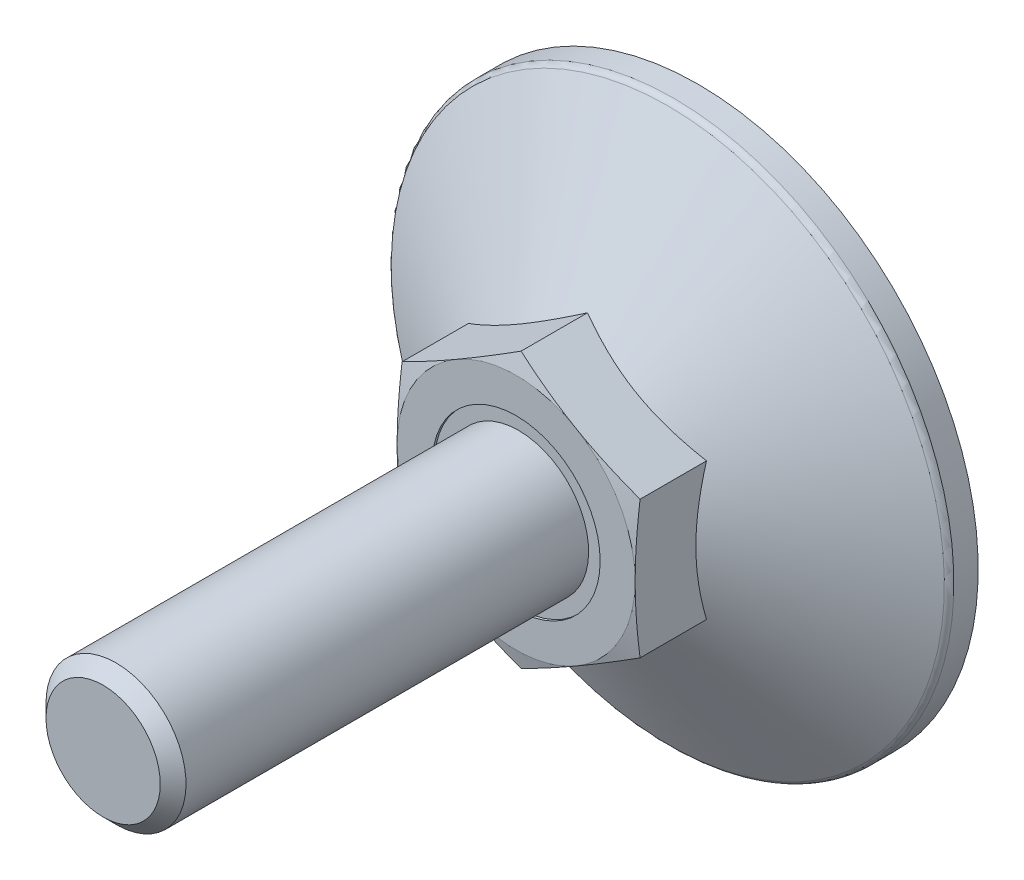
ISO-10303-21;
HEADER;
FILE_DESCRIPTION(('STEP AP214'),'2;1');
FILE_NAME('part.step','',(''),(''),'','','');
FILE_SCHEMA(('AUTOMOTIVE_DESIGN { 1 0 10303 214 1 1 1 1 }'));
ENDSEC;
DATA;
#1=APPLICATION_CONTEXT('core data for automotive mechanical design processes');
#2=APPLICATION_PROTOCOL_DEFINITION('international standard','automotive_design',2000,#1);
#3=PRODUCT_CONTEXT('',#1,'mechanical');
#4=PRODUCT('Part','Part','',(#3));
#5=PRODUCT_RELATED_PRODUCT_CATEGORY('part','',(#4));
#6=PRODUCT_DEFINITION_FORMATION('','',#4);
#7=PRODUCT_DEFINITION_CONTEXT('part definition',#1,'design');
#8=PRODUCT_DEFINITION('design','',#6,#7);
#9=PRODUCT_DEFINITION_SHAPE('','',#8);
#10=(LENGTH_UNIT() NAMED_UNIT(*) SI_UNIT(.MILLI.,.METRE.));
#11=(NAMED_UNIT(*) PLANE_ANGLE_UNIT() SI_UNIT($,.RADIAN.));
#12=(NAMED_UNIT(*) SI_UNIT($,.STERADIAN.) SOLID_ANGLE_UNIT());
#13=UNCERTAINTY_MEASURE_WITH_UNIT(LENGTH_MEASURE(1.E-05),#10,'distance_accuracy_value','');
#14=(GEOMETRIC_REPRESENTATION_CONTEXT(3) GLOBAL_UNCERTAINTY_ASSIGNED_CONTEXT((#13)) GLOBAL_UNIT_ASSIGNED_CONTEXT((#10,
#11,#12)) REPRESENTATION_CONTEXT('',''));
#15=CARTESIAN_POINT('',(0.,0.,0.));
#16=DIRECTION('',(0.,0.,1.));
#17=DIRECTION('',(1.,0.,0.));
#18=AXIS2_PLACEMENT_3D('',#15,#16,#17);
#19=CARTESIAN_POINT('',(0.,9.8149545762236,27.));
#20=DIRECTION('',(0.5,-0.86602540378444,0.));
#21=DIRECTION('',(0.86602540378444,0.5,0.));
#22=AXIS2_PLACEMENT_3D('',#19,#20,#21);
#23=PLANE('',#22);
#24=CARTESIAN_POINT('',(0.0002,9.81507004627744,12.6476280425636));
#25=CARTESIAN_POINT('',(-0.352800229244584,9.61126526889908,12.7022599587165));
#26=CARTESIAN_POINT('',(-0.706440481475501,9.40709097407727,12.7518566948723));
#27=CARTESIAN_POINT('',(-1.41496987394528,8.99802133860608,12.8389934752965));
#28=CARTESIAN_POINT('',(-1.76985946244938,8.79312573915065,12.8765286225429));
#29=CARTESIAN_POINT('',(-2.47873586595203,8.38385575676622,12.9373509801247));
#30=CARTESIAN_POINT('',(-2.83271788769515,8.17948414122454,12.9607107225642));
#31=CARTESIAN_POINT('',(-3.5411333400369,7.77048028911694,12.9920337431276));
#32=CARTESIAN_POINT('',(-3.89556667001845,7.56584811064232,13.));
#33=CARTESIAN_POINT('',(-4.60443332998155,7.15658375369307,13.));
#34=CARTESIAN_POINT('',(-4.9588666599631,6.95195157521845,12.9920337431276));
#35=CARTESIAN_POINT('',(-5.66728211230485,6.54294772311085,12.9607107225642));
#36=CARTESIAN_POINT('',(-6.02126413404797,6.33857610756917,12.9373509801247));
#37=CARTESIAN_POINT('',(-6.73014053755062,5.92930612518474,12.8765286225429));
#38=CARTESIAN_POINT('',(-7.08503012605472,5.7244105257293,12.8389934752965));
#39=CARTESIAN_POINT('',(-7.7935595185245,5.31534089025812,12.7518566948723));
#40=CARTESIAN_POINT('',(-8.14719977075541,5.11116659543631,12.7022599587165));
#41=CARTESIAN_POINT('',(-8.5002,4.90736181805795,12.6476280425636));
#42=B_SPLINE_CURVE_WITH_KNOTS('',3,(#24,#25,#26,#27,#28,#29,#30,#31,#32,#33,#34,#35,#36,#37,#38,
#39,#40,#41),.UNSPECIFIED.,.F.,.F.,(4,2,2,2,2,2,2,2,4),(0.,1.23382789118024,2.46815608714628,
3.69611406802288,4.92383440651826,6.15155474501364,7.37951272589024,8.61384092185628,
9.84766881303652),.UNSPECIFIED.);
#43=CARTESIAN_POINT('',(0.,9.8149545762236,12.6476589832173));
#44=VERTEX_POINT('',#43);
#45=CARTESIAN_POINT('',(-4.25,7.36121593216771,13.));
#46=VERTEX_POINT('',#45);
#47=EDGE_CURVE('E269',#44,#46,#42,.T.);
#48=ORIENTED_EDGE('',*,*,#47,.F.);
#49=DIRECTION('',(0.,0.,-1.));
#50=VECTOR('',#49,1.);
#51=CARTESIAN_POINT('',(0.,9.8149545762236,27.));
#52=LINE('',#51,#50);
#53=CARTESIAN_POINT('',(0.,9.8149545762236,7.90533871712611));
#54=VERTEX_POINT('',#53);
#55=EDGE_CURVE('E43',#44,#54,#52,.T.);
#56=ORIENTED_EDGE('',*,*,#55,.T.);
#57=CARTESIAN_POINT('',(-8.5002,4.90736181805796,7.90527204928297));
#58=CARTESIAN_POINT('',(-8.31336077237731,5.0152334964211,7.96754195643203));
#59=CARTESIAN_POINT('',(-8.1258249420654,5.12350735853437,8.02698579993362));
#60=CARTESIAN_POINT('',(-7.74923024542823,5.34093440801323,8.13944298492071));
#61=CARTESIAN_POINT('',(-7.56017075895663,5.45008795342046,8.19245355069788));
#62=CARTESIAN_POINT('',(-6.98996524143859,5.77929626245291,8.34079470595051));
#63=CARTESIAN_POINT('',(-6.60656835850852,6.00065055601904,8.42516916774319));
#64=CARTESIAN_POINT('',(-6.03282233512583,6.33190297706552,8.52410807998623));
#65=CARTESIAN_POINT('',(-5.8441872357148,6.44081150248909,8.55229289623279));
#66=CARTESIAN_POINT('',(-5.46606397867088,6.65912106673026,8.59955401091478));
#67=CARTESIAN_POINT('',(-5.27657589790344,6.76852206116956,8.61863111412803));
#68=CARTESIAN_POINT('',(-4.89727347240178,6.98751241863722,8.64719332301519));
#69=CARTESIAN_POINT('',(-4.70745974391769,7.0971014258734,8.65668931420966));
#70=CARTESIAN_POINT('',(-4.3276569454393,7.31638067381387,8.66588571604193));
#71=CARTESIAN_POINT('',(-4.13766788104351,7.42607091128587,8.66558642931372));
#72=CARTESIAN_POINT('',(-3.78247698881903,7.63114046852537,8.65587362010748));
#73=CARTESIAN_POINT('',(-3.61725009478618,7.7265342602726,8.64764492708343));
#74=CARTESIAN_POINT('',(-3.28718328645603,7.91709842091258,8.62393885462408));
#75=CARTESIAN_POINT('',(-3.12234339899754,8.01226877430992,8.60846098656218));
#76=CARTESIAN_POINT('',(-2.62846189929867,8.29741139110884,8.55151947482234));
#77=CARTESIAN_POINT('',(-2.30029449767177,8.48687892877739,8.49955503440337));
#78=CARTESIAN_POINT('',(-1.64047857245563,8.86782383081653,8.36964315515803));
#79=CARTESIAN_POINT('',(-1.30891425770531,9.0592525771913,8.29114502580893));
#80=CARTESIAN_POINT('',(-0.650730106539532,9.43925537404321,8.11298675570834));
#81=CARTESIAN_POINT('',(-0.324101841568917,9.62783429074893,8.01336845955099));
#82=CARTESIAN_POINT('',(0.000199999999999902,9.81507004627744,7.90527204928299));
#83=B_SPLINE_CURVE_WITH_KNOTS('',3,(#57,#58,#59,#60,#61,#62,#63,#64,#65,#66,#67,#68,#69,#70,#71,
#72,#73,#74,#75,#76,#77,#78,#79,#80,#81,#82),.UNSPECIFIED.,.F.,.F.,(4,2,2,2,2,2,2,2,2,2,2,2,4),
(0.,0.673596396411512,1.34748239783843,2.69805431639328,3.35679995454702,4.01548737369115,
4.67342558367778,5.33134346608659,5.90409556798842,6.47688628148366,7.62328361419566,
8.79510569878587,9.96462743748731),.UNSPECIFIED.);
#84=CARTESIAN_POINT('',(-8.5,4.9074772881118,7.90533871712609));
#85=VERTEX_POINT('',#84);
#86=EDGE_CURVE('E237',#85,#54,#83,.T.);
#87=ORIENTED_EDGE('',*,*,#86,.F.);
#88=DIRECTION('',(0.,0.,-1.));
#89=VECTOR('',#88,1.);
#90=CARTESIAN_POINT('',(-8.5,4.9074772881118,27.));
#91=LINE('',#90,#89);
#92=CARTESIAN_POINT('',(-8.5,4.9074772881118,12.6476589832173));
#93=VERTEX_POINT('',#92);
#94=EDGE_CURVE('E282',#93,#85,#91,.T.);
#95=ORIENTED_EDGE('',*,*,#94,.F.);
#96=EDGE_CURVE('E169',#46,#93,#42,.T.);
#97=ORIENTED_EDGE('',*,*,#96,.F.);
#98=EDGE_LOOP('',(#48,#56,#87,#95,#97));
#99=FACE_BOUND('',#98,.T.);
#100=ADVANCED_FACE('F14',(#99),#23,.F.);
#101=CARTESIAN_POINT('',(8.5,4.9074772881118,27.));
#102=DIRECTION('',(-0.5,-0.86602540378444,0.));
#103=DIRECTION('',(0.86602540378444,-0.5,0.));
#104=AXIS2_PLACEMENT_3D('',#101,#102,#103);
#105=PLANE('',#104);
#106=CARTESIAN_POINT('',(8.5002,4.90736181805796,12.6476280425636));
#107=CARTESIAN_POINT('',(8.14719977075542,5.11116659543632,12.7022599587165));
#108=CARTESIAN_POINT('',(7.7935595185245,5.31534089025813,12.7518566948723));
#109=CARTESIAN_POINT('',(7.08503012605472,5.72441052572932,12.8389934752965));
#110=CARTESIAN_POINT('',(6.73014053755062,5.92930612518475,12.8765286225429));
#111=CARTESIAN_POINT('',(6.02126413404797,6.33857610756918,12.9373509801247));
#112=CARTESIAN_POINT('',(5.66728211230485,6.54294772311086,12.9607107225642));
#113=CARTESIAN_POINT('',(4.9588666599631,6.95195157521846,12.9920337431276));
#114=CARTESIAN_POINT('',(4.60443332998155,7.15658375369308,13.));
#115=CARTESIAN_POINT('',(3.89556667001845,7.56584811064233,13.));
#116=CARTESIAN_POINT('',(3.5411333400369,7.77048028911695,12.9920337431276));
#117=CARTESIAN_POINT('',(2.83271788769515,8.17948414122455,12.9607107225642));
#118=CARTESIAN_POINT('',(2.47873586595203,8.38385575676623,12.9373509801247));
#119=CARTESIAN_POINT('',(1.76985946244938,8.79312573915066,12.8765286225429));
#120=CARTESIAN_POINT('',(1.41496987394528,8.99802133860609,12.8389934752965));
#121=CARTESIAN_POINT('',(0.706440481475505,9.40709097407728,12.7518566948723));
#122=CARTESIAN_POINT('',(0.352800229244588,9.61126526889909,12.7022599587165));
#123=CARTESIAN_POINT('',(-0.000199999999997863,9.81507004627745,12.6476280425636));
#124=B_SPLINE_CURVE_WITH_KNOTS('',3,(#106,#107,#108,#109,#110,#111,#112,#113,#114,#115,#116,
#117,#118,#119,#120,#121,#122,#123),.UNSPECIFIED.,.F.,.F.,(4,2,2,2,2,2,2,2,4),(0.,
1.23382789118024,2.46815608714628,3.69611406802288,4.92383440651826,6.15155474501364,
7.37951272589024,8.61384092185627,9.84766881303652),.UNSPECIFIED.);
#125=CARTESIAN_POINT('',(8.5,4.9074772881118,12.6476589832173));
#126=VERTEX_POINT('',#125);
#127=CARTESIAN_POINT('',(4.25,7.36121593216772,13.));
#128=VERTEX_POINT('',#127);
#129=EDGE_CURVE('E121',#126,#128,#124,.T.);
#130=ORIENTED_EDGE('',*,*,#129,.F.);
#131=DIRECTION('',(0.,0.,-1.));
#132=VECTOR('',#131,1.);
#133=CARTESIAN_POINT('',(8.5,4.9074772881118,27.));
#134=LINE('',#133,#132);
#135=CARTESIAN_POINT('',(8.5,4.9074772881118,7.90533871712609));
#136=VERTEX_POINT('',#135);
#137=EDGE_CURVE('E128',#126,#136,#134,.T.);
#138=ORIENTED_EDGE('',*,*,#137,.T.);
#139=CARTESIAN_POINT('',(-0.0002,9.81507004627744,7.90527204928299));
#140=CARTESIAN_POINT('',(0.186639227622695,9.7071983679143,7.96754195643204));
#141=CARTESIAN_POINT('',(0.374175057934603,9.59892450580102,8.02698579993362));
#142=CARTESIAN_POINT('',(0.750769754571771,9.38149745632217,8.13944298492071));
#143=CARTESIAN_POINT('',(0.939829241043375,9.27234391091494,8.19245355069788));
#144=CARTESIAN_POINT('',(1.51003475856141,8.94313560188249,8.34079470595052));
#145=CARTESIAN_POINT('',(1.89343164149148,8.72178130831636,8.42516916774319));
#146=CARTESIAN_POINT('',(2.46717766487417,8.39052888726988,8.52410807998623));
#147=CARTESIAN_POINT('',(2.6558127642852,8.28162036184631,8.55229289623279));
#148=CARTESIAN_POINT('',(3.03393602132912,8.06331079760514,8.59955401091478));
#149=CARTESIAN_POINT('',(3.22342410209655,7.95390980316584,8.61863111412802));
#150=CARTESIAN_POINT('',(3.60272652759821,7.73491944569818,8.64719332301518));
#151=CARTESIAN_POINT('',(3.79254025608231,7.62533043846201,8.65668931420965));
#152=CARTESIAN_POINT('',(4.1723430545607,7.40605119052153,8.66588571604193));
#153=CARTESIAN_POINT('',(4.36233211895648,7.29636095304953,8.66558642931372));
#154=CARTESIAN_POINT('',(4.71752301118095,7.09129139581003,8.65587362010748));
#155=CARTESIAN_POINT('',(4.88274990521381,6.9958976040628,8.64764492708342));
#156=CARTESIAN_POINT('',(5.21281671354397,6.80533344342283,8.62393885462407));
#157=CARTESIAN_POINT('',(5.37765660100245,6.71016309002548,8.60846098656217));
#158=CARTESIAN_POINT('',(5.87153810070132,6.42502047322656,8.55151947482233));
#159=CARTESIAN_POINT('',(6.19970550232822,6.23555293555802,8.49955503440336));
#160=CARTESIAN_POINT('',(6.85952142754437,5.85460803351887,8.36964315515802));
#161=CARTESIAN_POINT('',(7.19108574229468,5.6631792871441,8.29114502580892));
#162=CARTESIAN_POINT('',(7.84926989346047,5.28317649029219,8.11298675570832));
#163=CARTESIAN_POINT('',(8.17589815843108,5.09459757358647,8.01336845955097));
#164=CARTESIAN_POINT('',(8.5002,4.90736181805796,7.90527204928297));
#165=B_SPLINE_CURVE_WITH_KNOTS('',3,(#139,#140,#141,#142,#143,#144,#145,#146,#147,#148,#149,
#150,#151,#152,#153,#154,#155,#156,#157,#158,#159,#160,#161,#162,#163,#164),.UNSPECIFIED.,.F.,
.F.,(4,2,2,2,2,2,2,2,2,2,2,2,4),(0.,0.673596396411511,1.34748239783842,2.69805431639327,
3.35679995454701,4.01548737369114,4.67342558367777,5.33134346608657,5.90409556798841,
6.47688628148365,7.62328361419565,8.79510569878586,9.96462743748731),.UNSPECIFIED.);
#166=EDGE_CURVE('E231',#54,#136,#165,.T.);
#167=ORIENTED_EDGE('',*,*,#166,.F.);
#168=ORIENTED_EDGE('',*,*,#55,.F.);
#169=EDGE_CURVE('E138',#128,#44,#124,.T.);
#170=ORIENTED_EDGE('',*,*,#169,.F.);
#171=EDGE_LOOP('',(#130,#138,#167,#168,#170));
#172=FACE_BOUND('',#171,.T.);
#173=ADVANCED_FACE('F243',(#172),#105,.F.);
#174=CARTESIAN_POINT('',(8.5,-4.9074772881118,27.));
#175=DIRECTION('',(-1.,0.,0.));
#176=DIRECTION('',(0.,-1.,0.));
#177=AXIS2_PLACEMENT_3D('',#174,#175,#176);
#178=PLANE('',#177);
#179=CARTESIAN_POINT('',(8.5,-12.9903790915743,11.1178785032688));
#180=CARTESIAN_POINT('',(8.5,-12.6046640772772,11.2043386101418));
#181=CARTESIAN_POINT('',(8.5,-12.2187080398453,11.2897426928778));
#182=CARTESIAN_POINT('',(8.5,-11.4461955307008,11.4578687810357));
#183=CARTESIAN_POINT('',(8.5,-11.0596390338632,11.5405906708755));
#184=CARTESIAN_POINT('',(8.5,-10.2854620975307,11.7028540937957));
#185=CARTESIAN_POINT('',(8.5,-9.89784098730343,11.7823924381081));
#186=CARTESIAN_POINT('',(8.5,-9.12179257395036,11.9374315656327));
#187=CARTESIAN_POINT('',(8.5,-8.73336527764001,12.0129323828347));
#188=CARTESIAN_POINT('',(8.5,-7.95866003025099,12.1583532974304));
#189=CARTESIAN_POINT('',(8.5,-7.57238954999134,12.2283129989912));
#190=CARTESIAN_POINT('',(8.5,-6.79879542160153,12.3621336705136));
#191=CARTESIAN_POINT('',(8.5,-6.41147179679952,12.4259947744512));
#192=CARTESIAN_POINT('',(8.5,-5.63569520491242,12.5461821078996));
#193=CARTESIAN_POINT('',(8.5,-5.24724238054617,12.6025092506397));
#194=CARTESIAN_POINT('',(8.5,-4.46910032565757,12.7059702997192));
#195=CARTESIAN_POINT('',(8.5,-4.0794110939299,12.7531041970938));
#196=CARTESIAN_POINT('',(8.5,-3.29439639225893,12.836845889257));
#197=CARTESIAN_POINT('',(8.5,-2.89905727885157,12.8733276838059));
#198=CARTESIAN_POINT('',(8.5,-2.10738337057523,12.9332495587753));
#199=CARTESIAN_POINT('',(8.5,-1.71104859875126,12.9566899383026));
#200=CARTESIAN_POINT('',(8.5,-0.91795852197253,12.9891619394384));
#201=CARTESIAN_POINT('',(8.5,-0.521203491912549,12.9982001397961));
#202=CARTESIAN_POINT('',(8.5,0.272366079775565,13.0013119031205));
#203=CARTESIAN_POINT('',(8.5,0.669180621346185,12.9953854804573));
#204=CARTESIAN_POINT('',(8.5,1.46375572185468,12.9689012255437));
#205=CARTESIAN_POINT('',(8.5,1.8615144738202,12.9482902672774));
#206=CARTESIAN_POINT('',(8.5,2.65609763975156,12.8936142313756));
#207=CARTESIAN_POINT('',(8.5,3.05292203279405,12.8595488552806));
#208=CARTESIAN_POINT('',(8.5,3.84563292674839,12.779686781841));
#209=CARTESIAN_POINT('',(8.5,4.24151864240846,12.733882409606));
#210=CARTESIAN_POINT('',(8.5,5.03201569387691,12.632450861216));
#211=CARTESIAN_POINT('',(8.5,5.42662702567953,12.5768236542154));
#212=CARTESIAN_POINT('',(8.5,6.1890544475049,12.4613980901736));
#213=CARTESIAN_POINT('',(8.5,6.55694774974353,12.4021045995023));
#214=CARTESIAN_POINT('',(8.5,7.29176301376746,12.2777496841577));
#215=CARTESIAN_POINT('',(8.5,7.65868494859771,12.2126881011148));
#216=CARTESIAN_POINT('',(8.5,8.39169181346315,12.0778522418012));
#217=CARTESIAN_POINT('',(8.5,8.75777666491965,12.0080775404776));
#218=CARTESIAN_POINT('',(8.5,9.48919476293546,11.8646832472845));
#219=CARTESIAN_POINT('',(8.5,9.8545279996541,11.7910636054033));
#220=CARTESIAN_POINT('',(8.5,10.5846274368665,11.6406592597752));
#221=CARTESIAN_POINT('',(8.5,10.949393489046,11.5638738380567));
#222=CARTESIAN_POINT('',(8.5,11.6783699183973,11.4077053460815));
#223=CARTESIAN_POINT('',(8.5,12.042580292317,11.3283222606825));
#224=CARTESIAN_POINT('',(8.5,13.1344530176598,11.086978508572));
#225=CARTESIAN_POINT('',(8.5,13.8614066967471,10.9218129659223));
#226=CARTESIAN_POINT('',(8.5,15.3067849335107,10.5871769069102));
#227=CARTESIAN_POINT('',(8.5,16.0252230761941,10.4177646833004));
#228=CARTESIAN_POINT('',(8.5,17.4610979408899,10.0746978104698));
#229=CARTESIAN_POINT('',(8.5,18.1785346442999,9.90104308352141));
#230=CARTESIAN_POINT('',(8.5,19.6117525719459,9.55082113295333));
#231=CARTESIAN_POINT('',(8.5,20.3275347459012,9.37425778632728));
#232=CARTESIAN_POINT('',(8.5,21.7584760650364,9.01872306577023));
#233=CARTESIAN_POINT('',(8.5,22.4736352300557,8.83975177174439));
#234=CARTESIAN_POINT('',(8.5,23.188577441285,8.65992757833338));
#235=B_SPLINE_CURVE_WITH_KNOTS('',3,(#179,#180,#181,#182,#183,#184,#185,#186,#187,#188,#189,
#190,#191,#192,#193,#194,#195,#196,#197,#198,#199,#200,#201,#202,#203,#204,#205,#206,#207,#208,
#209,#210,#211,#212,#213,#214,#215,#216,#217,#218,#219,#220,#221,#222,#223,#224,#225,#226,#227,
#228,#229,#230,#231,#232,#233,#234),.UNSPECIFIED.,.F.,.F.,(4,2,2,2,2,2,2,2,2,2,2,2,2,2,2,2,2,2,
2,2,2,2,2,2,2,2,2,4),(0.,1.18586433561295,2.37177970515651,3.55885463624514,4.74591957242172,
5.92354482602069,7.1011442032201,8.27860070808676,9.45605836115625,10.646926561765,
11.8377674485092,13.0280642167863,14.2183598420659,15.4129837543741,16.6076341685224,
17.8030676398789,18.9985048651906,20.1163732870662,21.2342724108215,22.3522724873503,
23.470287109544,24.5885566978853,25.7068328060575,27.9432326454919,30.1576442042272,
32.3720963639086,34.5838036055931,36.7954376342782),.UNSPECIFIED.);
#236=CARTESIAN_POINT('',(8.5,-4.90747728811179,12.6476589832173));
#237=VERTEX_POINT('',#236);
#238=CARTESIAN_POINT('',(8.5,0.,13.));
#239=VERTEX_POINT('',#238);
#240=EDGE_CURVE('E95',#237,#239,#235,.T.);
#241=ORIENTED_EDGE('',*,*,#240,.F.);
#242=DIRECTION('',(0.,0.,-1.));
#243=VECTOR('',#242,1.);
#244=CARTESIAN_POINT('',(8.5,-4.9074772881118,27.));
#245=LINE('',#244,#243);
#246=CARTESIAN_POINT('',(8.5,-4.9074772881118,7.90533871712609));
#247=VERTEX_POINT('',#246);
#248=EDGE_CURVE('E275',#237,#247,#245,.T.);
#249=ORIENTED_EDGE('',*,*,#248,.T.);
#250=CARTESIAN_POINT('',(8.5,12.7492767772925,4.72527230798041));
#251=CARTESIAN_POINT('',(8.5,12.3811478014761,4.90206026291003));
#252=CARTESIAN_POINT('',(8.5,12.0121249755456,5.07702151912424));
#253=CARTESIAN_POINT('',(8.5,11.2718137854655,5.42225230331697));
#254=CARTESIAN_POINT('',(8.5,10.9005250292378,5.59252098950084));
#255=CARTESIAN_POINT('',(8.5,10.1530767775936,5.92827896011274));
#256=CARTESIAN_POINT('',(8.5,9.77690140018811,6.09373302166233));
#257=CARTESIAN_POINT('',(8.5,9.02139912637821,6.41725455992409));
#258=CARTESIAN_POINT('',(8.5,8.64207239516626,6.57532242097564));
#259=CARTESIAN_POINT('',(8.5,7.86979942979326,6.88607334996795));
#260=CARTESIAN_POINT('',(8.5,7.47675434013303,7.03851219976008));
#261=CARTESIAN_POINT('',(8.5,6.68591204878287,7.33076935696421));
#262=CARTESIAN_POINT('',(8.5,6.28811429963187,7.47058619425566));
#263=CARTESIAN_POINT('',(8.5,5.48802263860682,7.733611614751));
#264=CARTESIAN_POINT('',(8.5,5.08574124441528,7.85685783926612));
#265=CARTESIAN_POINT('',(8.5,4.27544970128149,8.08251258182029));
#266=CARTESIAN_POINT('',(8.5,3.86744153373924,8.18492812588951));
#267=CARTESIAN_POINT('',(8.5,3.04728386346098,8.36327495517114));
#268=CARTESIAN_POINT('',(8.5,2.6351585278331,8.43931422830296));
#269=CARTESIAN_POINT('',(8.5,2.01359122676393,8.53003978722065));
#270=CARTESIAN_POINT('',(8.5,1.80582110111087,8.55639399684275));
#271=CARTESIAN_POINT('',(8.5,1.38940213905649,8.60080126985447));
#272=CARTESIAN_POINT('',(8.5,1.18075338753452,8.61885511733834));
#273=CARTESIAN_POINT('',(8.5,0.765376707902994,8.64609671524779));
#274=CARTESIAN_POINT('',(8.5,0.558655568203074,8.65538769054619));
#275=CARTESIAN_POINT('',(8.5,0.1450067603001,8.66526416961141));
#276=CARTESIAN_POINT('',(8.5,-0.0619209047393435,8.6658498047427));
#277=CARTESIAN_POINT('',(8.5,-0.475626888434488,8.65830085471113));
#278=CARTESIAN_POINT('',(8.5,-0.682405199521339,8.65016585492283));
#279=CARTESIAN_POINT('',(8.5,-1.09545270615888,8.625363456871));
#280=CARTESIAN_POINT('',(8.5,-1.30172187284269,8.60869558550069));
#281=CARTESIAN_POINT('',(8.5,-1.81090940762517,8.55735076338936));
#282=CARTESIAN_POINT('',(8.5,-2.11335210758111,8.51788364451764));
#283=CARTESIAN_POINT('',(8.5,-2.71570235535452,8.4228634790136));
#284=CARTESIAN_POINT('',(8.5,-3.01560949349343,8.36730788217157));
#285=CARTESIAN_POINT('',(8.5,-3.61268959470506,8.2420877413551));
#286=CARTESIAN_POINT('',(8.5,-3.90986014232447,8.17241178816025));
#287=CARTESIAN_POINT('',(8.5,-4.50108875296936,8.02104250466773));
#288=CARTESIAN_POINT('',(8.5,-4.79514688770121,7.93934945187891));
#289=CARTESIAN_POINT('',(8.5,-5.3871494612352,7.7638116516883));
#290=CARTESIAN_POINT('',(8.5,-5.68502188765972,7.6697256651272));
#291=CARTESIAN_POINT('',(8.5,-6.27782977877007,7.4727599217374));
#292=CARTESIAN_POINT('',(8.5,-6.57276522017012,7.36988009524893));
#293=CARTESIAN_POINT('',(8.5,-7.15987047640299,7.15687683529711));
#294=CARTESIAN_POINT('',(8.5,-7.45204129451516,7.04675615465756));
#295=CARTESIAN_POINT('',(8.5,-8.03401937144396,6.82048197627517));
#296=CARTESIAN_POINT('',(8.5,-8.32382669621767,6.70432864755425));
#297=CARTESIAN_POINT('',(8.5,-8.8985343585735,6.468166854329));
#298=CARTESIAN_POINT('',(8.5,-9.18345493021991,6.34820749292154));
#299=CARTESIAN_POINT('',(8.5,-9.75152375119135,6.10415692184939));
#300=CARTESIAN_POINT('',(8.5,-10.034671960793,5.98006561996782));
#301=CARTESIAN_POINT('',(8.5,-10.8818575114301,5.60257794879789));
#302=CARTESIAN_POINT('',(8.5,-11.4435817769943,5.34399030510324));
#303=CARTESIAN_POINT('',(8.5,-12.5625477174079,4.81675169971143));
#304=CARTESIAN_POINT('',(8.5,-13.1197873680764,4.54809647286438));
#305=CARTESIAN_POINT('',(8.5,-14.2306052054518,4.00340707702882));
#306=CARTESIAN_POINT('',(8.5,-14.7841835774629,3.72737328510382));
#307=CARTESIAN_POINT('',(8.5,-15.8894273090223,3.16924748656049));
#308=CARTESIAN_POINT('',(8.5,-16.4410879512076,2.88714616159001));
#309=CARTESIAN_POINT('',(8.5,-17.5421722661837,2.31860293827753));
#310=CARTESIAN_POINT('',(8.5,-18.0915959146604,2.03216099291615));
#311=CARTESIAN_POINT('',(8.5,-19.1885131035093,1.45593769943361));
#312=CARTESIAN_POINT('',(8.5,-19.7360070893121,1.1661571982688));
#313=CARTESIAN_POINT('',(8.5,-20.8295421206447,0.583866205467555));
#314=CARTESIAN_POINT('',(8.5,-21.3755831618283,0.291355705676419));
#315=CARTESIAN_POINT('',(8.5,-22.8810608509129,-0.519031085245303));
#316=CARTESIAN_POINT('',(8.5,-23.8392547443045,-1.03921546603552));
#317=CARTESIAN_POINT('',(8.5,-25.7530641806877,-2.08445783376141));
#318=CARTESIAN_POINT('',(8.5,-26.708679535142,-2.60951616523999));
#319=CARTESIAN_POINT('',(8.5,-28.6148788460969,-3.66152013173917));
#320=CARTESIAN_POINT('',(8.5,-29.565469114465,-4.18845433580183));
#321=CARTESIAN_POINT('',(8.5,-30.9901906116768,-4.98085413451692));
#322=CARTESIAN_POINT('',(8.5,-31.4648842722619,-5.24530955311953));
#323=CARTESIAN_POINT('',(8.5,-32.4139385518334,-5.77481644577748));
#324=CARTESIAN_POINT('',(8.5,-32.8882991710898,-6.03986791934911));
#325=CARTESIAN_POINT('',(8.5,-33.3625145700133,-6.30517901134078));
#326=B_SPLINE_CURVE_WITH_KNOTS('',3,(#250,#251,#252,#253,#254,#255,#256,#257,#258,#259,#260,
#261,#262,#263,#264,#265,#266,#267,#268,#269,#270,#271,#272,#273,#274,#275,#276,#277,#278,#279,
#280,#281,#282,#283,#284,#285,#286,#287,#288,#289,#290,#291,#292,#293,#294,#295,#296,#297,#298,
#299,#300,#301,#302,#303,#304,#305,#306,#307,#308,#309,#310,#311,#312,#313,#314,#315,#316,#317,
#318,#319,#320,#321,#322,#323,#324,#325),.UNSPECIFIED.,.F.,.F.,(4,2,2,2,2,2,2,2,2,2,2,2,2,2,2,2,
2,2,2,2,2,2,2,2,2,2,2,2,2,2,2,2,2,2,2,2,2,4),(0.,1.22515253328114,2.45052343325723,
3.6833213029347,4.91605495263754,6.18059988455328,7.44529191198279,8.70706073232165,
9.96840325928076,11.2245189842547,11.852683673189,12.4807890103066,13.1013994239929,
13.7220004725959,14.3426310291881,14.9632960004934,15.8778021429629,16.7924533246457,
17.7078465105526,18.6232185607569,19.5601888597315,20.4971665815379,21.433790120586,
22.3703874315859,23.297780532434,24.225194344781,26.0801973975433,27.9359954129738,
29.7916987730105,31.6504906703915,33.5093027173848,35.3676531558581,37.2260091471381,
40.4968499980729,43.7679238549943,47.0285209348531,48.6586852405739,50.2888482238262),.UNSPECIFIED.);
#327=EDGE_CURVE('E197',#136,#247,#326,.T.);
#328=ORIENTED_EDGE('',*,*,#327,.F.);
#329=ORIENTED_EDGE('',*,*,#137,.F.);
#330=EDGE_CURVE('E106',#239,#126,#235,.T.);
#331=ORIENTED_EDGE('',*,*,#330,.F.);
#332=EDGE_LOOP('',(#241,#249,#328,#329,#331));
#333=FACE_BOUND('',#332,.T.);
#334=ADVANCED_FACE('F126',(#333),#178,.F.);
#335=CARTESIAN_POINT('',(0.,-9.8149545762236,27.));
#336=DIRECTION('',(-0.5,0.86602540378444,0.));
#337=DIRECTION('',(-0.86602540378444,-0.5,0.));
#338=AXIS2_PLACEMENT_3D('',#335,#336,#337);
#339=PLANE('',#338);
#340=CARTESIAN_POINT('',(-0.0002,-9.81507004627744,12.6476280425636));
#341=CARTESIAN_POINT('',(0.352800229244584,-9.61126526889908,12.7022599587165));
#342=CARTESIAN_POINT('',(0.706440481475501,-9.40709097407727,12.7518566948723));
#343=CARTESIAN_POINT('',(1.41496987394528,-8.99802133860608,12.8389934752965));
#344=CARTESIAN_POINT('',(1.76985946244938,-8.79312573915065,12.8765286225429));
#345=CARTESIAN_POINT('',(2.47873586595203,-8.38385575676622,12.9373509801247));
#346=CARTESIAN_POINT('',(2.83271788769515,-8.17948414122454,12.9607107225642));
#347=CARTESIAN_POINT('',(3.5411333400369,-7.77048028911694,12.9920337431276));
#348=CARTESIAN_POINT('',(3.89556667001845,-7.56584811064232,13.));
#349=CARTESIAN_POINT('',(4.60443332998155,-7.15658375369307,13.));
#350=CARTESIAN_POINT('',(4.9588666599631,-6.95195157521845,12.9920337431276));
#351=CARTESIAN_POINT('',(5.66728211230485,-6.54294772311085,12.9607107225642));
#352=CARTESIAN_POINT('',(6.02126413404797,-6.33857610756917,12.9373509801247));
#353=CARTESIAN_POINT('',(6.73014053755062,-5.92930612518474,12.8765286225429));
#354=CARTESIAN_POINT('',(7.08503012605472,-5.7244105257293,12.8389934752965));
#355=CARTESIAN_POINT('',(7.7935595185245,-5.31534089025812,12.7518566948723));
#356=CARTESIAN_POINT('',(8.14719977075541,-5.11116659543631,12.7022599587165));
#357=CARTESIAN_POINT('',(8.5002,-4.90736181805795,12.6476280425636));
#358=B_SPLINE_CURVE_WITH_KNOTS('',3,(#340,#341,#342,#343,#344,#345,#346,#347,#348,#349,#350,
#351,#352,#353,#354,#355,#356,#357),.UNSPECIFIED.,.F.,.F.,(4,2,2,2,2,2,2,2,4),(0.,
1.23382789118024,2.46815608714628,3.69611406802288,4.92383440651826,6.15155474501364,
7.37951272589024,8.61384092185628,9.84766881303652),.UNSPECIFIED.);
#359=CARTESIAN_POINT('',(0.,-9.81495457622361,12.6476589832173));
#360=VERTEX_POINT('',#359);
#361=CARTESIAN_POINT('',(4.25,-7.36121593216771,13.));
#362=VERTEX_POINT('',#361);
#363=EDGE_CURVE('E130',#360,#362,#358,.T.);
#364=ORIENTED_EDGE('',*,*,#363,.F.);
#365=DIRECTION('',(0.,0.,-1.));
#366=VECTOR('',#365,1.);
#367=CARTESIAN_POINT('',(0.,-9.8149545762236,27.));
#368=LINE('',#367,#366);
#369=CARTESIAN_POINT('',(0.,-9.8149545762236,7.90533871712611));
#370=VERTEX_POINT('',#369);
#371=EDGE_CURVE('E279',#360,#370,#368,.T.);
#372=ORIENTED_EDGE('',*,*,#371,.T.);
#373=CARTESIAN_POINT('',(8.5002,-4.90736181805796,7.90527204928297));
#374=CARTESIAN_POINT('',(8.31336077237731,-5.0152334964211,7.96754195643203));
#375=CARTESIAN_POINT('',(8.1258249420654,-5.12350735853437,8.02698579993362));
#376=CARTESIAN_POINT('',(7.74923024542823,-5.34093440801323,8.13944298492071));
#377=CARTESIAN_POINT('',(7.56017075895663,-5.45008795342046,8.19245355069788));
#378=CARTESIAN_POINT('',(6.98996524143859,-5.77929626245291,8.34079470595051));
#379=CARTESIAN_POINT('',(6.60656835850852,-6.00065055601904,8.42516916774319));
#380=CARTESIAN_POINT('',(6.03282233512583,-6.33190297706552,8.52410807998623));
#381=CARTESIAN_POINT('',(5.8441872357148,-6.44081150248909,8.55229289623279));
#382=CARTESIAN_POINT('',(5.46606397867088,-6.65912106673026,8.59955401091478));
#383=CARTESIAN_POINT('',(5.27657589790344,-6.76852206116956,8.61863111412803));
#384=CARTESIAN_POINT('',(4.89727347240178,-6.98751241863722,8.64719332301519));
#385=CARTESIAN_POINT('',(4.70745974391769,-7.0971014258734,8.65668931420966));
#386=CARTESIAN_POINT('',(4.3276569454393,-7.31638067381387,8.66588571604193));
#387=CARTESIAN_POINT('',(4.13766788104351,-7.42607091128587,8.66558642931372));
#388=CARTESIAN_POINT('',(3.78247698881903,-7.63114046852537,8.65587362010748));
#389=CARTESIAN_POINT('',(3.61725009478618,-7.7265342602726,8.64764492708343));
#390=CARTESIAN_POINT('',(3.28718328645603,-7.91709842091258,8.62393885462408));
#391=CARTESIAN_POINT('',(3.12234339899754,-8.01226877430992,8.60846098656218));
#392=CARTESIAN_POINT('',(2.62846189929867,-8.29741139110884,8.55151947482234));
#393=CARTESIAN_POINT('',(2.30029449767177,-8.48687892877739,8.49955503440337));
#394=CARTESIAN_POINT('',(1.64047857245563,-8.86782383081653,8.36964315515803));
#395=CARTESIAN_POINT('',(1.30891425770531,-9.0592525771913,8.29114502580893));
#396=CARTESIAN_POINT('',(0.650730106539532,-9.43925537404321,8.11298675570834));
#397=CARTESIAN_POINT('',(0.324101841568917,-9.62783429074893,8.01336845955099));
#398=CARTESIAN_POINT('',(-0.000199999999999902,-9.81507004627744,7.90527204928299));
#399=B_SPLINE_CURVE_WITH_KNOTS('',3,(#373,#374,#375,#376,#377,#378,#379,#380,#381,#382,#383,
#384,#385,#386,#387,#388,#389,#390,#391,#392,#393,#394,#395,#396,#397,#398),.UNSPECIFIED.,.F.,
.F.,(4,2,2,2,2,2,2,2,2,2,2,2,4),(0.,0.673596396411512,1.34748239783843,2.69805431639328,
3.35679995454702,4.01548737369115,4.67342558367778,5.33134346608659,5.90409556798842,
6.47688628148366,7.62328361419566,8.79510569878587,9.96462743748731),.UNSPECIFIED.);
#400=EDGE_CURVE('E188',#247,#370,#399,.T.);
#401=ORIENTED_EDGE('',*,*,#400,.F.);
#402=ORIENTED_EDGE('',*,*,#248,.F.);
#403=EDGE_CURVE('E101',#362,#237,#358,.T.);
#404=ORIENTED_EDGE('',*,*,#403,.F.);
#405=EDGE_LOOP('',(#364,#372,#401,#402,#404));
#406=FACE_BOUND('',#405,.T.);
#407=ADVANCED_FACE('F180',(#406),#339,.F.);
#408=CARTESIAN_POINT('',(-8.5,-4.9074772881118,27.));
#409=DIRECTION('',(0.5,0.86602540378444,0.));
#410=DIRECTION('',(-0.86602540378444,0.5,0.));
#411=AXIS2_PLACEMENT_3D('',#408,#409,#410);
#412=PLANE('',#411);
#413=CARTESIAN_POINT('',(-8.5002,-4.90736181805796,12.6476280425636));
#414=CARTESIAN_POINT('',(-8.14719977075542,-5.11116659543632,12.7022599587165));
#415=CARTESIAN_POINT('',(-7.7935595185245,-5.31534089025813,12.7518566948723));
#416=CARTESIAN_POINT('',(-7.08503012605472,-5.72441052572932,12.8389934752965));
#417=CARTESIAN_POINT('',(-6.73014053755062,-5.92930612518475,12.8765286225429));
#418=CARTESIAN_POINT('',(-6.02126413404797,-6.33857610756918,12.9373509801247));
#419=CARTESIAN_POINT('',(-5.66728211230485,-6.54294772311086,12.9607107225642));
#420=CARTESIAN_POINT('',(-4.9588666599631,-6.95195157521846,12.9920337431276));
#421=CARTESIAN_POINT('',(-4.60443332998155,-7.15658375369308,13.));
#422=CARTESIAN_POINT('',(-3.89556667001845,-7.56584811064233,13.));
#423=CARTESIAN_POINT('',(-3.5411333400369,-7.77048028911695,12.9920337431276));
#424=CARTESIAN_POINT('',(-2.83271788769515,-8.17948414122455,12.9607107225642));
#425=CARTESIAN_POINT('',(-2.47873586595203,-8.38385575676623,12.9373509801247));
#426=CARTESIAN_POINT('',(-1.76985946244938,-8.79312573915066,12.8765286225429));
#427=CARTESIAN_POINT('',(-1.41496987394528,-8.99802133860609,12.8389934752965));
#428=CARTESIAN_POINT('',(-0.706440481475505,-9.40709097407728,12.7518566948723));
#429=CARTESIAN_POINT('',(-0.352800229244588,-9.61126526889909,12.7022599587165));
#430=CARTESIAN_POINT('',(0.000199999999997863,-9.81507004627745,12.6476280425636));
#431=B_SPLINE_CURVE_WITH_KNOTS('',3,(#413,#414,#415,#416,#417,#418,#419,#420,#421,#422,#423,
#424,#425,#426,#427,#428,#429,#430),.UNSPECIFIED.,.F.,.F.,(4,2,2,2,2,2,2,2,4),(0.,
1.23382789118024,2.46815608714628,3.69611406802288,4.92383440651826,6.15155474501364,
7.37951272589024,8.61384092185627,9.84766881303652),.UNSPECIFIED.);
#432=CARTESIAN_POINT('',(-8.5,-4.9074772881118,12.6476589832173));
#433=VERTEX_POINT('',#432);
#434=CARTESIAN_POINT('',(-4.25,-7.36121593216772,13.));
#435=VERTEX_POINT('',#434);
#436=EDGE_CURVE('E161',#433,#435,#431,.T.);
#437=ORIENTED_EDGE('',*,*,#436,.F.);
#438=DIRECTION('',(0.,0.,-1.));
#439=VECTOR('',#438,1.);
#440=CARTESIAN_POINT('',(-8.5,-4.9074772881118,27.));
#441=LINE('',#440,#439);
#442=CARTESIAN_POINT('',(-8.5,-4.9074772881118,7.90533871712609));
#443=VERTEX_POINT('',#442);
#444=EDGE_CURVE('E281',#433,#443,#441,.T.);
#445=ORIENTED_EDGE('',*,*,#444,.T.);
#446=CARTESIAN_POINT('',(0.0002,-9.81507004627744,7.90527204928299));
#447=CARTESIAN_POINT('',(-0.186639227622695,-9.7071983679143,7.96754195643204));
#448=CARTESIAN_POINT('',(-0.374175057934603,-9.59892450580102,8.02698579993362));
#449=CARTESIAN_POINT('',(-0.750769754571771,-9.38149745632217,8.13944298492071));
#450=CARTESIAN_POINT('',(-0.939829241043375,-9.27234391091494,8.19245355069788));
#451=CARTESIAN_POINT('',(-1.51003475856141,-8.94313560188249,8.34079470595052));
#452=CARTESIAN_POINT('',(-1.89343164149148,-8.72178130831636,8.42516916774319));
#453=CARTESIAN_POINT('',(-2.46717766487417,-8.39052888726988,8.52410807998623));
#454=CARTESIAN_POINT('',(-2.6558127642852,-8.28162036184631,8.55229289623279));
#455=CARTESIAN_POINT('',(-3.03393602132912,-8.06331079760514,8.59955401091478));
#456=CARTESIAN_POINT('',(-3.22342410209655,-7.95390980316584,8.61863111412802));
#457=CARTESIAN_POINT('',(-3.60272652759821,-7.73491944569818,8.64719332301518));
#458=CARTESIAN_POINT('',(-3.79254025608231,-7.62533043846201,8.65668931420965));
#459=CARTESIAN_POINT('',(-4.1723430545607,-7.40605119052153,8.66588571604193));
#460=CARTESIAN_POINT('',(-4.36233211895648,-7.29636095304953,8.66558642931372));
#461=CARTESIAN_POINT('',(-4.71752301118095,-7.09129139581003,8.65587362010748));
#462=CARTESIAN_POINT('',(-4.88274990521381,-6.9958976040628,8.64764492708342));
#463=CARTESIAN_POINT('',(-5.21281671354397,-6.80533344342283,8.62393885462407));
#464=CARTESIAN_POINT('',(-5.37765660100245,-6.71016309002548,8.60846098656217));
#465=CARTESIAN_POINT('',(-5.87153810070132,-6.42502047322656,8.55151947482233));
#466=CARTESIAN_POINT('',(-6.19970550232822,-6.23555293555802,8.49955503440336));
#467=CARTESIAN_POINT('',(-6.85952142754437,-5.85460803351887,8.36964315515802));
#468=CARTESIAN_POINT('',(-7.19108574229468,-5.6631792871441,8.29114502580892));
#469=CARTESIAN_POINT('',(-7.84926989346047,-5.28317649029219,8.11298675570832));
#470=CARTESIAN_POINT('',(-8.17589815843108,-5.09459757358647,8.01336845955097));
#471=CARTESIAN_POINT('',(-8.5002,-4.90736181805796,7.90527204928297));
#472=B_SPLINE_CURVE_WITH_KNOTS('',3,(#446,#447,#448,#449,#450,#451,#452,#453,#454,#455,#456,
#457,#458,#459,#460,#461,#462,#463,#464,#465,#466,#467,#468,#469,#470,#471),.UNSPECIFIED.,.F.,
.F.,(4,2,2,2,2,2,2,2,2,2,2,2,4),(0.,0.673596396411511,1.34748239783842,2.69805431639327,
3.35679995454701,4.01548737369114,4.67342558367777,5.33134346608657,5.90409556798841,
6.47688628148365,7.62328361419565,8.79510569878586,9.96462743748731),.UNSPECIFIED.);
#473=EDGE_CURVE('E198',#370,#443,#472,.T.);
#474=ORIENTED_EDGE('',*,*,#473,.F.);
#475=ORIENTED_EDGE('',*,*,#371,.F.);
#476=EDGE_CURVE('E179',#435,#360,#431,.T.);
#477=ORIENTED_EDGE('',*,*,#476,.F.);
#478=EDGE_LOOP('',(#437,#445,#474,#475,#477));
#479=FACE_BOUND('',#478,.T.);
#480=ADVANCED_FACE('F183',(#479),#412,.F.);
#481=CARTESIAN_POINT('',(-8.5,4.9074772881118,27.));
#482=DIRECTION('',(1.,0.,0.));
#483=DIRECTION('',(0.,1.,0.));
#484=AXIS2_PLACEMENT_3D('',#481,#482,#483);
#485=PLANE('',#484);
#486=CARTESIAN_POINT('',(-8.5,-12.9903790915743,11.1178785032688));
#487=CARTESIAN_POINT('',(-8.5,-12.6046640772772,11.2043386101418));
#488=CARTESIAN_POINT('',(-8.5,-12.2187080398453,11.2897426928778));
#489=CARTESIAN_POINT('',(-8.5,-11.4461955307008,11.4578687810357));
#490=CARTESIAN_POINT('',(-8.5,-11.0596390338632,11.5405906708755));
#491=CARTESIAN_POINT('',(-8.5,-10.2854620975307,11.7028540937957));
#492=CARTESIAN_POINT('',(-8.5,-9.89784098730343,11.7823924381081));
#493=CARTESIAN_POINT('',(-8.5,-9.12179257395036,11.9374315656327));
#494=CARTESIAN_POINT('',(-8.5,-8.73336527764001,12.0129323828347));
#495=CARTESIAN_POINT('',(-8.5,-7.95866003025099,12.1583532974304));
#496=CARTESIAN_POINT('',(-8.5,-7.57238954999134,12.2283129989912));
#497=CARTESIAN_POINT('',(-8.5,-6.79879542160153,12.3621336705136));
#498=CARTESIAN_POINT('',(-8.5,-6.41147179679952,12.4259947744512));
#499=CARTESIAN_POINT('',(-8.5,-5.63569520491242,12.5461821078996));
#500=CARTESIAN_POINT('',(-8.5,-5.24724238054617,12.6025092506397));
#501=CARTESIAN_POINT('',(-8.5,-4.46910032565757,12.7059702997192));
#502=CARTESIAN_POINT('',(-8.5,-4.0794110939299,12.7531041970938));
#503=CARTESIAN_POINT('',(-8.5,-3.29439639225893,12.836845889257));
#504=CARTESIAN_POINT('',(-8.5,-2.89905727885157,12.8733276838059));
#505=CARTESIAN_POINT('',(-8.5,-2.10738337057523,12.9332495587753));
#506=CARTESIAN_POINT('',(-8.5,-1.71104859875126,12.9566899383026));
#507=CARTESIAN_POINT('',(-8.5,-0.91795852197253,12.9891619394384));
#508=CARTESIAN_POINT('',(-8.5,-0.521203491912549,12.9982001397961));
#509=CARTESIAN_POINT('',(-8.5,0.272366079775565,13.0013119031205));
#510=CARTESIAN_POINT('',(-8.5,0.669180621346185,12.9953854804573));
#511=CARTESIAN_POINT('',(-8.5,1.46375572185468,12.9689012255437));
#512=CARTESIAN_POINT('',(-8.5,1.8615144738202,12.9482902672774));
#513=CARTESIAN_POINT('',(-8.5,2.65609763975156,12.8936142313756));
#514=CARTESIAN_POINT('',(-8.5,3.05292203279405,12.8595488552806));
#515=CARTESIAN_POINT('',(-8.5,3.84563292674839,12.779686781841));
#516=CARTESIAN_POINT('',(-8.5,4.24151864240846,12.733882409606));
#517=CARTESIAN_POINT('',(-8.5,5.03201569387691,12.632450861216));
#518=CARTESIAN_POINT('',(-8.5,5.42662702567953,12.5768236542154));
#519=CARTESIAN_POINT('',(-8.5,6.1890544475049,12.4613980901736));
#520=CARTESIAN_POINT('',(-8.5,6.55694774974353,12.4021045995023));
#521=CARTESIAN_POINT('',(-8.5,7.29176301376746,12.2777496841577));
#522=CARTESIAN_POINT('',(-8.5,7.65868494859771,12.2126881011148));
#523=CARTESIAN_POINT('',(-8.5,8.39169181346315,12.0778522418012));
#524=CARTESIAN_POINT('',(-8.5,8.75777666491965,12.0080775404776));
#525=CARTESIAN_POINT('',(-8.5,9.48919476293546,11.8646832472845));
#526=CARTESIAN_POINT('',(-8.5,9.8545279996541,11.7910636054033));
#527=CARTESIAN_POINT('',(-8.5,10.5846274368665,11.6406592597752));
#528=CARTESIAN_POINT('',(-8.5,10.949393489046,11.5638738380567));
#529=CARTESIAN_POINT('',(-8.5,11.6783699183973,11.4077053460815));
#530=CARTESIAN_POINT('',(-8.5,12.042580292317,11.3283222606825));
#531=CARTESIAN_POINT('',(-8.5,13.1344530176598,11.086978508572));
#532=CARTESIAN_POINT('',(-8.5,13.8614066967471,10.9218129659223));
#533=CARTESIAN_POINT('',(-8.5,15.3067849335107,10.5871769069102));
#534=CARTESIAN_POINT('',(-8.5,16.0252230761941,10.4177646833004));
#535=CARTESIAN_POINT('',(-8.5,17.4610979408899,10.0746978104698));
#536=CARTESIAN_POINT('',(-8.5,18.1785346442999,9.90104308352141));
#537=CARTESIAN_POINT('',(-8.5,19.6117525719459,9.55082113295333));
#538=CARTESIAN_POINT('',(-8.5,20.3275347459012,9.37425778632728));
#539=CARTESIAN_POINT('',(-8.5,21.7584760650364,9.01872306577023));
#540=CARTESIAN_POINT('',(-8.5,22.4736352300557,8.83975177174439));
#541=CARTESIAN_POINT('',(-8.5,23.188577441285,8.65992757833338));
#542=B_SPLINE_CURVE_WITH_KNOTS('',3,(#486,#487,#488,#489,#490,#491,#492,#493,#494,#495,#496,
#497,#498,#499,#500,#501,#502,#503,#504,#505,#506,#507,#508,#509,#510,#511,#512,#513,#514,#515,
#516,#517,#518,#519,#520,#521,#522,#523,#524,#525,#526,#527,#528,#529,#530,#531,#532,#533,#534,
#535,#536,#537,#538,#539,#540,#541),.UNSPECIFIED.,.F.,.F.,(4,2,2,2,2,2,2,2,2,2,2,2,2,2,2,2,2,2,
2,2,2,2,2,2,2,2,2,4),(0.,1.18586433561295,2.37177970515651,3.55885463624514,4.74591957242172,
5.92354482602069,7.1011442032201,8.27860070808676,9.45605836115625,10.646926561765,
11.8377674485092,13.0280642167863,14.2183598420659,15.4129837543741,16.6076341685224,
17.8030676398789,18.9985048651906,20.1163732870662,21.2342724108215,22.3522724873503,
23.470287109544,24.5885566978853,25.7068328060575,27.9432326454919,30.1576442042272,
32.3720963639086,34.5838036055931,36.7954376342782),.UNSPECIFIED.);
#543=CARTESIAN_POINT('',(-8.5,0.,13.));
#544=VERTEX_POINT('',#543);
#545=EDGE_CURVE('E9',#93,#544,#542,.F.);
#546=ORIENTED_EDGE('',*,*,#545,.F.);
#547=ORIENTED_EDGE('',*,*,#94,.T.);
#548=CARTESIAN_POINT('',(-8.5,12.7492767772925,4.72527230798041));
#549=CARTESIAN_POINT('',(-8.5,12.3811478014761,4.90206026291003));
#550=CARTESIAN_POINT('',(-8.5,12.0121249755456,5.07702151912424));
#551=CARTESIAN_POINT('',(-8.5,11.2718137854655,5.42225230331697));
#552=CARTESIAN_POINT('',(-8.5,10.9005250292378,5.59252098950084));
#553=CARTESIAN_POINT('',(-8.5,10.1530767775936,5.92827896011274));
#554=CARTESIAN_POINT('',(-8.5,9.77690140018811,6.09373302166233));
#555=CARTESIAN_POINT('',(-8.5,9.02139912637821,6.41725455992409));
#556=CARTESIAN_POINT('',(-8.5,8.64207239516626,6.57532242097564));
#557=CARTESIAN_POINT('',(-8.5,7.86979942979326,6.88607334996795));
#558=CARTESIAN_POINT('',(-8.5,7.47675434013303,7.03851219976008));
#559=CARTESIAN_POINT('',(-8.5,6.68591204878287,7.33076935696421));
#560=CARTESIAN_POINT('',(-8.5,6.28811429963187,7.47058619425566));
#561=CARTESIAN_POINT('',(-8.5,5.48802263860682,7.733611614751));
#562=CARTESIAN_POINT('',(-8.5,5.08574124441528,7.85685783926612));
#563=CARTESIAN_POINT('',(-8.5,4.27544970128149,8.08251258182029));
#564=CARTESIAN_POINT('',(-8.5,3.86744153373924,8.18492812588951));
#565=CARTESIAN_POINT('',(-8.5,3.04728386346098,8.36327495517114));
#566=CARTESIAN_POINT('',(-8.5,2.6351585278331,8.43931422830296));
#567=CARTESIAN_POINT('',(-8.5,2.01359122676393,8.53003978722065));
#568=CARTESIAN_POINT('',(-8.5,1.80582110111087,8.55639399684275));
#569=CARTESIAN_POINT('',(-8.5,1.38940213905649,8.60080126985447));
#570=CARTESIAN_POINT('',(-8.5,1.18075338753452,8.61885511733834));
#571=CARTESIAN_POINT('',(-8.5,0.765376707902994,8.64609671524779));
#572=CARTESIAN_POINT('',(-8.5,0.558655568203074,8.65538769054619));
#573=CARTESIAN_POINT('',(-8.5,0.1450067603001,8.66526416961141));
#574=CARTESIAN_POINT('',(-8.5,-0.0619209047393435,8.6658498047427));
#575=CARTESIAN_POINT('',(-8.5,-0.475626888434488,8.65830085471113));
#576=CARTESIAN_POINT('',(-8.5,-0.682405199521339,8.65016585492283));
#577=CARTESIAN_POINT('',(-8.5,-1.09545270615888,8.625363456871));
#578=CARTESIAN_POINT('',(-8.5,-1.30172187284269,8.60869558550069));
#579=CARTESIAN_POINT('',(-8.5,-1.81090940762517,8.55735076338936));
#580=CARTESIAN_POINT('',(-8.5,-2.11335210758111,8.51788364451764));
#581=CARTESIAN_POINT('',(-8.5,-2.71570235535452,8.4228634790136));
#582=CARTESIAN_POINT('',(-8.5,-3.01560949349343,8.36730788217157));
#583=CARTESIAN_POINT('',(-8.5,-3.61268959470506,8.2420877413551));
#584=CARTESIAN_POINT('',(-8.5,-3.90986014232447,8.17241178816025));
#585=CARTESIAN_POINT('',(-8.5,-4.50108875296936,8.02104250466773));
#586=CARTESIAN_POINT('',(-8.5,-4.79514688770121,7.93934945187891));
#587=CARTESIAN_POINT('',(-8.5,-5.3871494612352,7.7638116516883));
#588=CARTESIAN_POINT('',(-8.5,-5.68502188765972,7.6697256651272));
#589=CARTESIAN_POINT('',(-8.5,-6.27782977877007,7.4727599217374));
#590=CARTESIAN_POINT('',(-8.5,-6.57276522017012,7.36988009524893));
#591=CARTESIAN_POINT('',(-8.5,-7.15987047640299,7.15687683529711));
#592=CARTESIAN_POINT('',(-8.5,-7.45204129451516,7.04675615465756));
#593=CARTESIAN_POINT('',(-8.5,-8.03401937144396,6.82048197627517));
#594=CARTESIAN_POINT('',(-8.5,-8.32382669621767,6.70432864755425));
#595=CARTESIAN_POINT('',(-8.5,-8.8985343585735,6.468166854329));
#596=CARTESIAN_POINT('',(-8.5,-9.18345493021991,6.34820749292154));
#597=CARTESIAN_POINT('',(-8.5,-9.75152375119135,6.10415692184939));
#598=CARTESIAN_POINT('',(-8.5,-10.034671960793,5.98006561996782));
#599=CARTESIAN_POINT('',(-8.5,-10.8818575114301,5.60257794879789));
#600=CARTESIAN_POINT('',(-8.5,-11.4435817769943,5.34399030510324));
#601=CARTESIAN_POINT('',(-8.5,-12.5625477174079,4.81675169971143));
#602=CARTESIAN_POINT('',(-8.5,-13.1197873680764,4.54809647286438));
#603=CARTESIAN_POINT('',(-8.5,-14.2306052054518,4.00340707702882));
#604=CARTESIAN_POINT('',(-8.5,-14.7841835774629,3.72737328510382));
#605=CARTESIAN_POINT('',(-8.5,-15.8894273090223,3.16924748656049));
#606=CARTESIAN_POINT('',(-8.5,-16.4410879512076,2.88714616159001));
#607=CARTESIAN_POINT('',(-8.5,-17.5421722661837,2.31860293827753));
#608=CARTESIAN_POINT('',(-8.5,-18.0915959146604,2.03216099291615));
#609=CARTESIAN_POINT('',(-8.5,-19.1885131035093,1.45593769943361));
#610=CARTESIAN_POINT('',(-8.5,-19.7360070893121,1.1661571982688));
#611=CARTESIAN_POINT('',(-8.5,-20.8295421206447,0.583866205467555));
#612=CARTESIAN_POINT('',(-8.5,-21.3755831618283,0.291355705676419));
#613=CARTESIAN_POINT('',(-8.5,-22.8810608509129,-0.519031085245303));
#614=CARTESIAN_POINT('',(-8.5,-23.8392547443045,-1.03921546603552));
#615=CARTESIAN_POINT('',(-8.5,-25.7530641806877,-2.08445783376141));
#616=CARTESIAN_POINT('',(-8.5,-26.708679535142,-2.60951616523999));
#617=CARTESIAN_POINT('',(-8.5,-28.6148788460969,-3.66152013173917));
#618=CARTESIAN_POINT('',(-8.5,-29.565469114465,-4.18845433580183));
#619=CARTESIAN_POINT('',(-8.5,-30.9901906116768,-4.98085413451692));
#620=CARTESIAN_POINT('',(-8.5,-31.4648842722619,-5.24530955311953));
#621=CARTESIAN_POINT('',(-8.5,-32.4139385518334,-5.77481644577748));
#622=CARTESIAN_POINT('',(-8.5,-32.8882991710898,-6.03986791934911));
#623=CARTESIAN_POINT('',(-8.5,-33.3625145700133,-6.30517901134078));
#624=B_SPLINE_CURVE_WITH_KNOTS('',3,(#548,#549,#550,#551,#552,#553,#554,#555,#556,#557,#558,
#559,#560,#561,#562,#563,#564,#565,#566,#567,#568,#569,#570,#571,#572,#573,#574,#575,#576,#577,
#578,#579,#580,#581,#582,#583,#584,#585,#586,#587,#588,#589,#590,#591,#592,#593,#594,#595,#596,
#597,#598,#599,#600,#601,#602,#603,#604,#605,#606,#607,#608,#609,#610,#611,#612,#613,#614,#615,
#616,#617,#618,#619,#620,#621,#622,#623),.UNSPECIFIED.,.F.,.F.,(4,2,2,2,2,2,2,2,2,2,2,2,2,2,2,2,
2,2,2,2,2,2,2,2,2,2,2,2,2,2,2,2,2,2,2,2,2,4),(0.,1.22515253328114,2.45052343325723,
3.6833213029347,4.91605495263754,6.18059988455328,7.44529191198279,8.70706073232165,
9.96840325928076,11.2245189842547,11.852683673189,12.4807890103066,13.1013994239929,
13.7220004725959,14.3426310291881,14.9632960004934,15.8778021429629,16.7924533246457,
17.7078465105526,18.6232185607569,19.5601888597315,20.4971665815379,21.433790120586,
22.3703874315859,23.297780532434,24.225194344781,26.0801973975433,27.9359954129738,
29.7916987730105,31.6504906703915,33.5093027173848,35.3676531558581,37.2260091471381,
40.4968499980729,43.7679238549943,47.0285209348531,48.6586852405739,50.2888482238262),.UNSPECIFIED.);
#625=EDGE_CURVE('E220',#443,#85,#624,.F.);
#626=ORIENTED_EDGE('',*,*,#625,.F.);
#627=ORIENTED_EDGE('',*,*,#444,.F.);
#628=EDGE_CURVE('E18',#544,#433,#542,.F.);
#629=ORIENTED_EDGE('',*,*,#628,.F.);
#630=EDGE_LOOP('',(#546,#547,#626,#627,#629));
#631=FACE_BOUND('',#630,.T.);
#632=ADVANCED_FACE('F300',(#631),#485,.F.);
#633=CARTESIAN_POINT('',(0.,0.,0.));
#634=DIRECTION('',(0.,0.,-1.));
#635=DIRECTION('',(0.,1.,0.));
#636=AXIS2_PLACEMENT_3D('',#633,#634,#635);
#637=CYLINDRICAL_SURFACE('',#636,20.);
#638=CARTESIAN_POINT('',(0.,0.,0.));
#639=DIRECTION('',(0.,0.,-1.));
#640=DIRECTION('',(0.,1.,0.));
#641=AXIS2_PLACEMENT_3D('',#638,#639,#640);
#642=CIRCLE('',#641,20.);
#643=CARTESIAN_POINT('',(0.,20.,0.));
#644=VERTEX_POINT('',#643);
#645=EDGE_CURVE('E473',#644,#644,#642,.T.);
#646=ORIENTED_EDGE('',*,*,#645,.F.);
#647=EDGE_LOOP('',(#646));
#648=FACE_BOUND('',#647,.T.);
#649=CARTESIAN_POINT('',(0.,0.,1.7363248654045));
#650=DIRECTION('',(0.,0.,-1.));
#651=DIRECTION('',(0.,1.,0.));
#652=AXIS2_PLACEMENT_3D('',#649,#650,#651);
#653=CIRCLE('',#652,20.);
#654=CARTESIAN_POINT('',(0.,20.,1.7363248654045));
#655=VERTEX_POINT('',#654);
#656=EDGE_CURVE('E470',#655,#655,#653,.T.);
#657=ORIENTED_EDGE('',*,*,#656,.T.);
#658=EDGE_LOOP('',(#657));
#659=FACE_BOUND('',#658,.T.);
#660=ADVANCED_FACE('F302',(#648,#659),#637,.T.);
#661=CARTESIAN_POINT('',(0.,0.,1.7363248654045));
#662=DIRECTION('',(0.,0.,-1.));
#663=DIRECTION('',(0.,1.,0.));
#664=AXIS2_PLACEMENT_3D('',#661,#662,#663);
#665=TOROIDAL_SURFACE('',#664,19.4999999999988,0.500000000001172);
#666=CARTESIAN_POINT('',(0.,0.,2.1693375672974));
#667=DIRECTION('',(0.,0.,-1.));
#668=DIRECTION('',(0.,1.,0.));
#669=AXIS2_PLACEMENT_3D('',#666,#667,#668);
#670=CIRCLE('',#669,19.75);
#671=CARTESIAN_POINT('',(0.,19.75,2.1693375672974));
#672=VERTEX_POINT('',#671);
#673=EDGE_CURVE('E468',#672,#672,#670,.T.);
#674=ORIENTED_EDGE('',*,*,#673,.T.);
#675=EDGE_LOOP('',(#674));
#676=FACE_BOUND('',#675,.T.);
#677=ORIENTED_EDGE('',*,*,#656,.F.);
#678=EDGE_LOOP('',(#677));
#679=FACE_BOUND('',#678,.T.);
#680=ADVANCED_FACE('F213',(#676,#679),#665,.T.);
#681=CARTESIAN_POINT('',(0.,0.,13.572005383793));
#682=DIRECTION('',(0.,0.,-1.));
#683=DIRECTION('',(0.,1.,0.));
#684=AXIS2_PLACEMENT_3D('',#681,#682,#683);
#685=CONICAL_SURFACE('',#684,0.,1.04719755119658);
#686=ORIENTED_EDGE('',*,*,#673,.F.);
#687=EDGE_LOOP('',(#686));
#688=FACE_BOUND('',#687,.T.);
#689=ORIENTED_EDGE('',*,*,#625,.T.);
#690=ORIENTED_EDGE('',*,*,#86,.T.);
#691=ORIENTED_EDGE('',*,*,#166,.T.);
#692=ORIENTED_EDGE('',*,*,#327,.T.);
#693=ORIENTED_EDGE('',*,*,#400,.T.);
#694=ORIENTED_EDGE('',*,*,#473,.T.);
#695=EDGE_LOOP('',(#689,#690,#691,#692,#693,#694));
#696=FACE_BOUND('',#695,.T.);
#697=ADVANCED_FACE('F209',(#688,#696),#685,.T.);
#698=CARTESIAN_POINT('',(10.2,0.,0.));
#699=DIRECTION('',(0.,0.,1.));
#700=DIRECTION('',(0.,-1.,0.));
#701=AXIS2_PLACEMENT_3D('',#698,#699,#700);
#702=PLANE('',#701);
#703=ORIENTED_EDGE('',*,*,#645,.T.);
#704=EDGE_LOOP('',(#703));
#705=FACE_BOUND('',#704,.T.);
#706=ADVANCED_FACE('F151',(#705),#702,.F.);
#707=CARTESIAN_POINT('',(0.,0.,13.));
#708=DIRECTION('',(0.,0.,-1.));
#709=DIRECTION('',(-1.,0.,0.));
#710=AXIS2_PLACEMENT_3D('',#707,#708,#709);
#711=CONICAL_SURFACE('',#710,8.5,1.30899693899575);
#712=ORIENTED_EDGE('',*,*,#240,.T.);
#713=CARTESIAN_POINT('',(0.,0.,13.));
#714=DIRECTION('',(0.,0.,1.));
#715=DIRECTION('',(1.,0.,0.));
#716=AXIS2_PLACEMENT_3D('',#713,#714,#715);
#717=CIRCLE('',#716,8.5);
#718=EDGE_CURVE('E98',#362,#239,#717,.T.);
#719=ORIENTED_EDGE('',*,*,#718,.F.);
#720=ORIENTED_EDGE('',*,*,#403,.T.);
#721=EDGE_LOOP('',(#712,#719,#720));
#722=FACE_BOUND('',#721,.T.);
#723=ADVANCED_FACE('F97',(#722),#711,.T.);
#724=ORIENTED_EDGE('',*,*,#330,.T.);
#725=ORIENTED_EDGE('',*,*,#129,.T.);
#726=EDGE_CURVE('E112',#239,#128,#717,.T.);
#727=ORIENTED_EDGE('',*,*,#726,.F.);
#728=EDGE_LOOP('',(#724,#725,#727));
#729=FACE_BOUND('',#728,.T.);
#730=ADVANCED_FACE('F119',(#729),#711,.T.);
#731=ORIENTED_EDGE('',*,*,#169,.T.);
#732=ORIENTED_EDGE('',*,*,#47,.T.);
#733=EDGE_CURVE('E124',#128,#46,#717,.T.);
#734=ORIENTED_EDGE('',*,*,#733,.F.);
#735=EDGE_LOOP('',(#731,#732,#734));
#736=FACE_BOUND('',#735,.T.);
#737=ADVANCED_FACE('F435',(#736),#711,.T.);
#738=ORIENTED_EDGE('',*,*,#363,.T.);
#739=EDGE_CURVE('E115',#435,#362,#717,.T.);
#740=ORIENTED_EDGE('',*,*,#739,.F.);
#741=ORIENTED_EDGE('',*,*,#476,.T.);
#742=EDGE_LOOP('',(#738,#740,#741));
#743=FACE_BOUND('',#742,.T.);
#744=ADVANCED_FACE('F426',(#743),#711,.T.);
#745=ORIENTED_EDGE('',*,*,#96,.T.);
#746=ORIENTED_EDGE('',*,*,#545,.T.);
#747=EDGE_CURVE('E35',#46,#544,#717,.T.);
#748=ORIENTED_EDGE('',*,*,#747,.F.);
#749=EDGE_LOOP('',(#745,#746,#748));
#750=FACE_BOUND('',#749,.T.);
#751=ADVANCED_FACE('F418',(#750),#711,.T.);
#752=ORIENTED_EDGE('',*,*,#436,.T.);
#753=EDGE_CURVE('E295',#544,#435,#717,.T.);
#754=ORIENTED_EDGE('',*,*,#753,.F.);
#755=ORIENTED_EDGE('',*,*,#628,.T.);
#756=EDGE_LOOP('',(#752,#754,#755));
#757=FACE_BOUND('',#756,.T.);
#758=ADVANCED_FACE('F152',(#757),#711,.T.);
#759=CARTESIAN_POINT('',(0.,5.67414233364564,13.));
#760=DIRECTION('',(0.,0.,1.));
#761=DIRECTION('',(1.,0.,0.));
#762=AXIS2_PLACEMENT_3D('',#759,#760,#761);
#763=PLANE('',#762);
#764=ORIENTED_EDGE('',*,*,#726,.T.);
#765=ORIENTED_EDGE('',*,*,#733,.T.);
#766=ORIENTED_EDGE('',*,*,#747,.T.);
#767=ORIENTED_EDGE('',*,*,#753,.T.);
#768=ORIENTED_EDGE('',*,*,#739,.T.);
#769=ORIENTED_EDGE('',*,*,#718,.T.);
#770=EDGE_LOOP('',(#764,#765,#766,#767,#768,#769));
#771=FACE_BOUND('',#770,.T.);
#772=CARTESIAN_POINT('',(0.,0.,13.));
#773=DIRECTION('',(0.,0.,1.));
#774=DIRECTION('',(1.,0.,0.));
#775=AXIS2_PLACEMENT_3D('',#772,#773,#774);
#776=CIRCLE('',#775,6.);
#777=CARTESIAN_POINT('',(6.,0.,13.));
#778=VERTEX_POINT('',#777);
#779=EDGE_CURVE('E299',#778,#778,#776,.F.);
#780=ORIENTED_EDGE('',*,*,#779,.T.);
#781=EDGE_LOOP('',(#780));
#782=FACE_BOUND('',#781,.T.);
#783=ADVANCED_FACE('F110',(#771,#782),#763,.T.);
#784=CARTESIAN_POINT('',(0.,0.,0.));
#785=DIRECTION('',(0.,0.,-1.));
#786=DIRECTION('',(0.,1.,0.));
#787=AXIS2_PLACEMENT_3D('',#784,#785,#786);
#788=CYLINDRICAL_SURFACE('',#787,6.);
#789=CARTESIAN_POINT('',(0.,0.,12.825));
#790=DIRECTION('',(0.,0.,-1.));
#791=DIRECTION('',(0.,1.,0.));
#792=AXIS2_PLACEMENT_3D('',#789,#790,#791);
#793=CIRCLE('',#792,6.);
#794=CARTESIAN_POINT('',(0.,6.,12.825));
#795=VERTEX_POINT('',#794);
#796=EDGE_CURVE('E273',#795,#795,#793,.T.);
#797=ORIENTED_EDGE('',*,*,#796,.T.);
#798=EDGE_LOOP('',(#797));
#799=FACE_BOUND('',#798,.T.);
#800=ORIENTED_EDGE('',*,*,#779,.F.);
#801=EDGE_LOOP('',(#800));
#802=FACE_BOUND('',#801,.T.);
#803=ADVANCED_FACE('F251',(#799,#802),#788,.F.);
#804=CARTESIAN_POINT('',(0.,0.,12.825));
#805=DIRECTION('',(0.,0.,-1.));
#806=DIRECTION('',(0.,1.,0.));
#807=AXIS2_PLACEMENT_3D('',#804,#805,#806);
#808=PLANE('',#807);
#809=ORIENTED_EDGE('',*,*,#796,.F.);
#810=EDGE_LOOP('',(#809));
#811=FACE_BOUND('',#810,.T.);
#812=CARTESIAN_POINT('',(0.,0.,12.825));
#813=DIRECTION('',(0.,0.,-1.));
#814=DIRECTION('',(0.,1.,0.));
#815=AXIS2_PLACEMENT_3D('',#812,#813,#814);
#816=CIRCLE('',#815,5.);
#817=CARTESIAN_POINT('',(0.,5.,12.825));
#818=VERTEX_POINT('',#817);
#819=EDGE_CURVE('E105',#818,#818,#816,.F.);
#820=ORIENTED_EDGE('',*,*,#819,.F.);
#821=EDGE_LOOP('',(#820));
#822=FACE_BOUND('',#821,.T.);
#823=ADVANCED_FACE('F16',(#811,#822),#808,.F.);
#824=CARTESIAN_POINT('',(0.,0.,0.));
#825=DIRECTION('',(0.,0.,-1.));
#826=DIRECTION('',(0.,1.,0.));
#827=AXIS2_PLACEMENT_3D('',#824,#825,#826);
#828=CYLINDRICAL_SURFACE('',#827,5.);
#829=ORIENTED_EDGE('',*,*,#819,.T.);
#830=EDGE_LOOP('',(#829));
#831=FACE_BOUND('',#830,.T.);
#832=CARTESIAN_POINT('',(0.,0.,41.58));
#833=DIRECTION('',(0.,0.,-1.));
#834=DIRECTION('',(-1.,0.,0.));
#835=AXIS2_PLACEMENT_3D('',#832,#833,#834);
#836=CIRCLE('',#835,5.);
#837=CARTESIAN_POINT('',(-5.,0.,41.58));
#838=VERTEX_POINT('',#837);
#839=EDGE_CURVE('E123',#838,#838,#836,.F.);
#840=ORIENTED_EDGE('',*,*,#839,.F.);
#841=EDGE_LOOP('',(#840));
#842=FACE_BOUND('',#841,.T.);
#843=ADVANCED_FACE('F260',(#831,#842),#828,.T.);
#844=CARTESIAN_POINT('',(0.,0.,42.5));
#845=DIRECTION('',(0.,0.,1.));
#846=DIRECTION('',(1.,0.,0.));
#847=AXIS2_PLACEMENT_3D('',#844,#845,#846);
#848=PLANE('',#847);
#849=CARTESIAN_POINT('',(0.,0.,42.5));
#850=DIRECTION('',(0.,0.,1.));
#851=DIRECTION('',(1.,0.,0.));
#852=AXIS2_PLACEMENT_3D('',#849,#850,#851);
#853=CIRCLE('',#852,4.08);
#854=CARTESIAN_POINT('',(4.08,0.,42.5));
#855=VERTEX_POINT('',#854);
#856=EDGE_CURVE('E116',#855,#855,#853,.T.);
#857=ORIENTED_EDGE('',*,*,#856,.T.);
#858=EDGE_LOOP('',(#857));
#859=FACE_BOUND('',#858,.T.);
#860=ADVANCED_FACE('F153',(#859),#848,.T.);
#861=CARTESIAN_POINT('',(0.,0.,42.5));
#862=DIRECTION('',(0.,0.,-1.));
#863=DIRECTION('',(-1.,0.,0.));
#864=AXIS2_PLACEMENT_3D('',#861,#862,#863);
#865=CONICAL_SURFACE('',#864,4.08,0.785398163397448);
#866=ORIENTED_EDGE('',*,*,#856,.F.);
#867=EDGE_LOOP('',(#866));
#868=FACE_BOUND('',#867,.T.);
#869=ORIENTED_EDGE('',*,*,#839,.T.);
#870=EDGE_LOOP('',(#869));
#871=FACE_BOUND('',#870,.T.);
#872=ADVANCED_FACE('F401',(#868,#871),#865,.T.);
#873=CLOSED_SHELL('',(#100,#173,#334,#407,#480,#632,#660,#680,#697,#706,#723,#730,#737,#744,
#751,#758,#783,#803,#823,#843,#860,#872));
#874=MANIFOLD_SOLID_BREP('B1',#873);
#875=ADVANCED_BREP_SHAPE_REPRESENTATION('',(#18,#874),#14);
#876=SHAPE_DEFINITION_REPRESENTATION(#9,#875);
ENDSEC;
END-ISO-10303-21;
